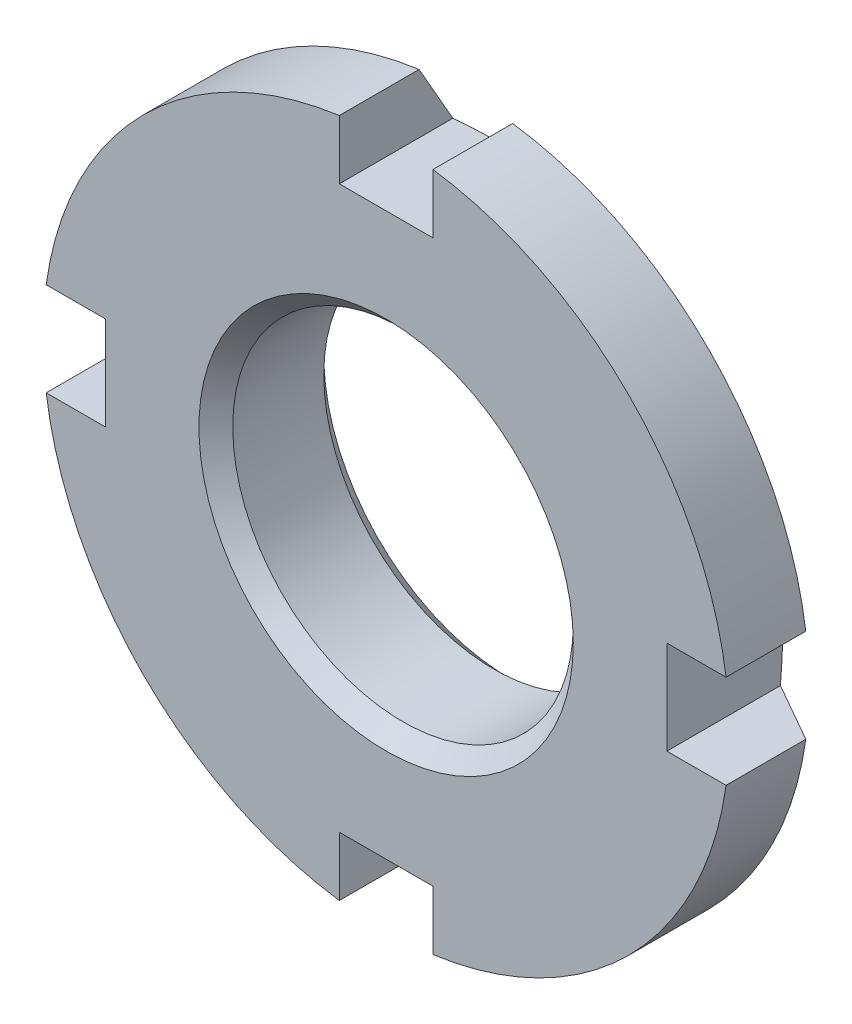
from build123d import *

# Parameters (mm, degrees)
SKETCH2_R          = 22
CUT_EXTRUDE1_DEPTH = 4


with BuildPart() as part:
    # Sketch1 → Revolve1 (revolve)
    with BuildSketch(Plane(origin=(0, 0, 0), x_dir=(0, 0, -1), z_dir=(1, 0, 0)), mode=Mode.PRIVATE) as revolve1_sk:
        Polygon((0, 11), (0, 6), (0.5415, 5.4585), (3.4585, 5.4585), (4, 6), (4, 8.5), (2.556624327, 11), align=None)
    revolve(revolve1_sk.sketch.rotate(Axis((0, 0, -4), (0, 0, 1)), 270), axis=Axis((0, 0, -4), (0, 0, 1)))

    # Sketch2 → Cut-Extrude1 (cut)
    with BuildSketch(Plane.XY):
        Circle(SKETCH2_R)
        with BuildLine():
            Line((-16.856468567, 1.5), (-9, 1.5))
            Line((-9, 1.5), (-9, -1.5))
            Line((-9, -1.5), (-16.856468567, -1.5))
            ThreePointArc((-16.856468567, -1.5), (-11.966422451, -11.966422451), (-1.5, -16.856468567))
            Line((-1.5, -16.856468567), (-1.5, -9))
            Line((-1.5, -9), (1.5, -9))
            Line((1.5, -9), (1.5, -16.856468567))
            ThreePointArc((1.5, -16.856468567), (11.966422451, -11.966422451), (16.856468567, -1.5))
            Line((16.856468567, -1.5), (9, -1.5))
            Line((9, -1.5), (9, 1.5))
            Line((9, 1.5), (16.856468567, 1.5))
            ThreePointArc((16.856468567, 1.5), (11.966422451, 11.966422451), (1.5, 16.856468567))
            Line((1.5, 16.856468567), (1.5, 9))
            Line((1.5, 9), (-1.5, 9))
            Line((-1.5, 9), (-1.5, 16.856468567))
            ThreePointArc((-1.5, 16.856468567), (-11.966422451, 11.966422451), (-16.856468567, 1.5))
        make_face(mode=Mode.SUBTRACT)
    extrude(amount=-CUT_EXTRUDE1_DEPTH, mode=Mode.SUBTRACT)


solid = part.part
